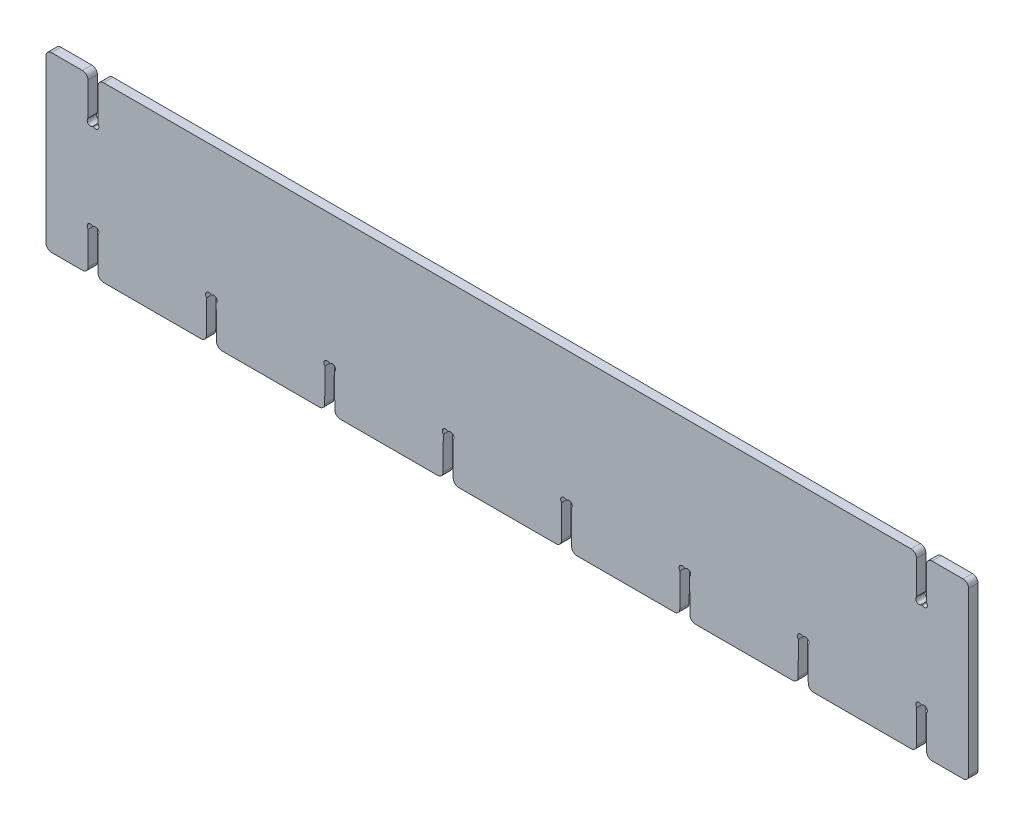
from build123d import *

# Parameters (mm, degrees)
ESQUISSE1_W         = 588.5
ESQUISSE1_H         = 220.8
BOSS_EXTRUDE1_DEPTH = 12
CUT_EXTRUDE1_DEPTH  = 629.672323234
LPATTERN1_COUNT     = 4
LPATTERN1_PITCH     = 151
CONG_1_R            = 7


with BuildPart() as part:
    # Esquisse1 → Boss-Extrude1 (new body)
    with BuildSketch(Plane.XY):
        with Locations((294.25, 110.4)):
            Rectangle(ESQUISSE1_W, ESQUISSE1_H)
    extrude(amount=BOSS_EXTRUDE1_DEPTH)

    # Esquisse2 → Cut-Extrude1 (cut, through all)
    with BuildSketch(Plane.XY.offset(12)):
        with BuildLine():
            Line((59.867332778, 55.2), (60.132667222, 55.2))
            ThreePointArc((60.132667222, 55.2), (60.514806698, 55.262472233), (60.857157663, 55.443384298))
            ThreePointArc((60.857157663, 55.443384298), (66.321786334, 54.981041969), (66.438077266, 49.498122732))
            ThreePointArc((66.438077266, 49.498122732), (66.220633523, 49.128471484), (66.147058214, 48.705966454))
            Line((66.147058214, 48.705966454), (66.5, 0))
            Line((66.5, 0), (53.5, 0))
            Line((53.5, 0), (53.852941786, 48.705966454))
            ThreePointArc((53.852941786, 48.705966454), (53.779366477, 49.128471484), (53.561922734, 49.498122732))
            ThreePointArc((53.561922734, 49.498122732), (53.678213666, 54.981041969), (59.142842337, 55.443384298))
            ThreePointArc((59.142842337, 55.443384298), (59.485193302, 55.262472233), (59.867332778, 55.2))
        make_face()
    cut_extrude1 = extrude(amount=-CUT_EXTRUDE1_DEPTH, mode=Mode.SUBTRACT)

    # Mirror1: Cut-Extrude1 across plane
    add(cut_extrude1.mirror(Plane.ZX.offset(110.4)), mode=Mode.SUBTRACT)

    # LPattern1: Cut-Extrude1 ×4
    with Locations(*[(i * LPATTERN1_PITCH, 0, 0) for i in range(1, LPATTERN1_COUNT)]):
        add(cut_extrude1, mode=Mode.SUBTRACT)

    # Cong_1
    cong_1_edges = [part.edges().sort_by_distance(p)[0] for p in [
        (368.5, 0, 6),
        (355.5, 0, 6),
        (519.5, 0, 6),
        (506.5, 0, 6),
        (66.5, 0, 6),
        (53.5, 0, 6),
        (53.5, 220.8, 6),
        (66.5, 220.8, 6),
        (0, 220.8, 6),
        (0, 0, 6),
        (217.5, 0, 6),
        (204.5, 0, 6),
    ]]
    fillet(cong_1_edges, radius=CONG_1_R)

    # Sym_trie1: part across plane


with BuildPart() as part_1:
    add(part.part)
    add(part.part.mirror(Plane(origin=(588.5, 0, 12), x_dir=(0, 0, 1), z_dir=(-1, 0, 0))))


solid = part_1.part
